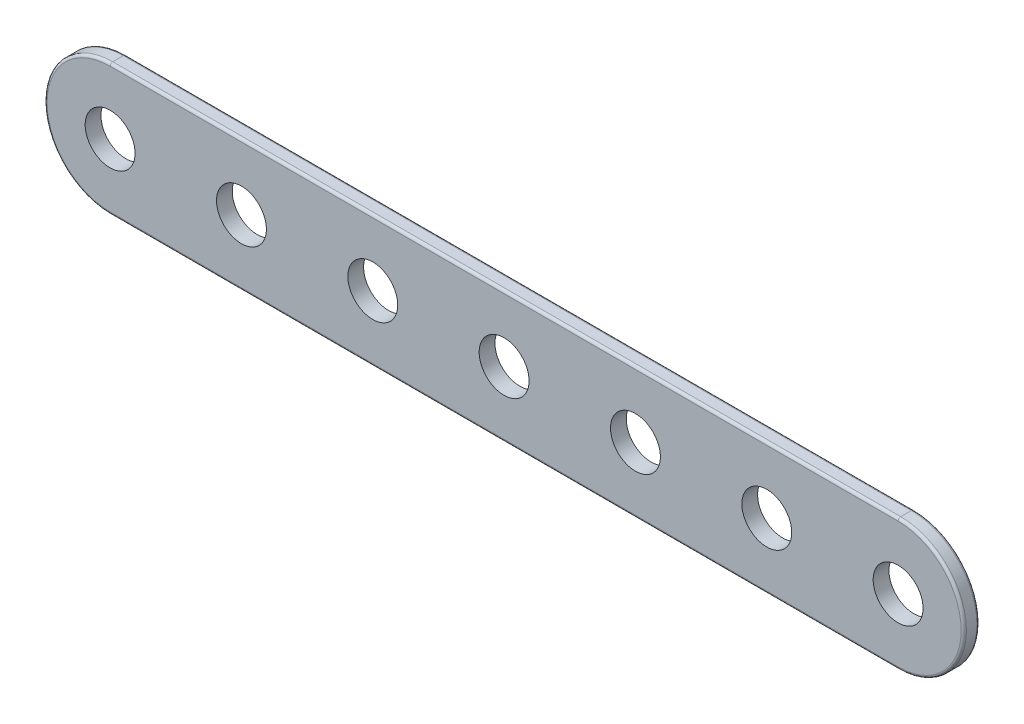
from build123d import *

# Parameters (mm, degrees)
BOSS_EXTRUDE1_DEPTH = 1.524
SKETCH2_R           = 2.413
CUT_EXTRUDE1_DEPTH  = 45.927136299
LPATTERN1_COUNT     = 7
LPATTERN1_PITCH     = 12.7
FILLET1_R           = 0.254


with BuildPart() as part:
    # Sketch1 → Boss-Extrude1 (new body)
    with BuildSketch(Plane.XY):
        with BuildLine():
            Line((-38.1, -6.35), (38.1, -6.35))
            ThreePointArc((38.1, -6.35), (44.45, 0), (38.1, 6.35))
            Line((38.1, 6.35), (-38.1, 6.35))
            ThreePointArc((-38.1, 6.35), (-44.45, 0), (-38.1, -6.35))
        make_face()
    extrude(amount=BOSS_EXTRUDE1_DEPTH)

    # Sketch2 → Cut-Extrude1 (cut, through all)
    with BuildSketch(Plane.XY.offset(1.524)):
        with Locations((-38.1, 0)):
            Circle(SKETCH2_R)
    cut_extrude1 = extrude(amount=-CUT_EXTRUDE1_DEPTH, mode=Mode.SUBTRACT)

    # LPattern1: Cut-Extrude1 ×7
    with Locations(*[(i * LPATTERN1_PITCH, 0, 0) for i in range(1, LPATTERN1_COUNT)]):
        add(cut_extrude1, mode=Mode.SUBTRACT)

    # Fillet1
    fillet1_edges = [part.edges().sort_by_distance(p)[0] for p in [
        (-44.45, 0, 1.524),
        (0, -6.35, 1.524),
        (44.45, 0, 1.524),
        (0, -6.35, 0),
        (-44.45, 0, 0),
        (0, 6.35, 0),
        (44.45, 0, 0),
        (0, 6.35, 1.524),
    ]]
    fillet(fillet1_edges, radius=FILLET1_R)


solid = part.part
